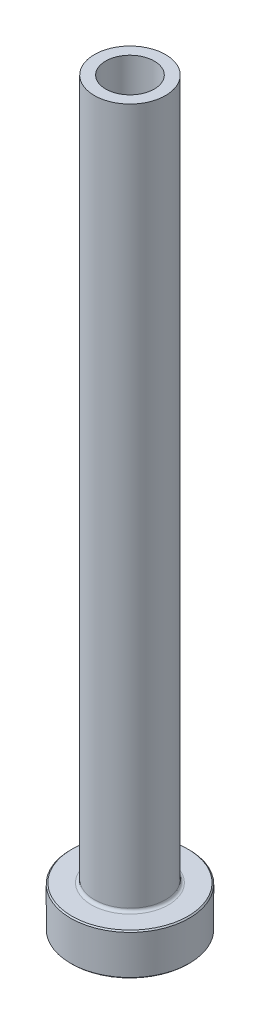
ISO-10303-21;
HEADER;
FILE_DESCRIPTION(('STEP AP214'),'2;1');
FILE_NAME('part.step','',(''),(''),'','','');
FILE_SCHEMA(('AUTOMOTIVE_DESIGN { 1 0 10303 214 1 1 1 1 }'));
ENDSEC;
DATA;
#1=APPLICATION_CONTEXT('core data for automotive mechanical design processes');
#2=APPLICATION_PROTOCOL_DEFINITION('international standard','automotive_design',2000,#1);
#3=PRODUCT_CONTEXT('',#1,'mechanical');
#4=PRODUCT('Part','Part','',(#3));
#5=PRODUCT_RELATED_PRODUCT_CATEGORY('part','',(#4));
#6=PRODUCT_DEFINITION_FORMATION('','',#4);
#7=PRODUCT_DEFINITION_CONTEXT('part definition',#1,'design');
#8=PRODUCT_DEFINITION('design','',#6,#7);
#9=PRODUCT_DEFINITION_SHAPE('','',#8);
#10=(LENGTH_UNIT() NAMED_UNIT(*) SI_UNIT(.MILLI.,.METRE.));
#11=(NAMED_UNIT(*) PLANE_ANGLE_UNIT() SI_UNIT($,.RADIAN.));
#12=(NAMED_UNIT(*) SI_UNIT($,.STERADIAN.) SOLID_ANGLE_UNIT());
#13=UNCERTAINTY_MEASURE_WITH_UNIT(LENGTH_MEASURE(1.E-05),#10,'distance_accuracy_value','');
#14=(GEOMETRIC_REPRESENTATION_CONTEXT(3) GLOBAL_UNCERTAINTY_ASSIGNED_CONTEXT((#13)) GLOBAL_UNIT_ASSIGNED_CONTEXT((#10,
#11,#12)) REPRESENTATION_CONTEXT('',''));
#15=CARTESIAN_POINT('',(0.,0.,0.));
#16=DIRECTION('',(0.,0.,1.));
#17=DIRECTION('',(1.,0.,0.));
#18=AXIS2_PLACEMENT_3D('',#15,#16,#17);
#19=CARTESIAN_POINT('',(0.,92.1876809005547,0.));
#20=DIRECTION('',(0.,1.,0.));
#21=DIRECTION('',(0.,0.,1.));
#22=AXIS2_PLACEMENT_3D('',#19,#20,#21);
#23=CYLINDRICAL_SURFACE('',#22,4.09999999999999);
#24=CARTESIAN_POINT('',(0.,125.,0.));
#25=DIRECTION('',(0.,1.,0.));
#26=DIRECTION('',(0.,0.,1.));
#27=AXIS2_PLACEMENT_3D('',#24,#25,#26);
#28=CIRCLE('',#27,4.1);
#29=CARTESIAN_POINT('',(0.,125.,4.1));
#30=VERTEX_POINT('',#29);
#31=EDGE_CURVE('E62',#30,#30,#28,.T.);
#32=ORIENTED_EDGE('',*,*,#31,.T.);
#33=EDGE_LOOP('',(#32));
#34=FACE_BOUND('',#33,.T.);
#35=CARTESIAN_POINT('',(0.,80.,0.));
#36=DIRECTION('',(0.,1.,0.));
#37=DIRECTION('',(0.,0.,1.));
#38=AXIS2_PLACEMENT_3D('',#35,#36,#37);
#39=CIRCLE('',#38,4.09999999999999);
#40=CARTESIAN_POINT('',(0.,80.,4.09999999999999));
#41=VERTEX_POINT('',#40);
#42=EDGE_CURVE('E71',#41,#41,#39,.T.);
#43=ORIENTED_EDGE('',*,*,#42,.F.);
#44=EDGE_LOOP('',(#43));
#45=FACE_BOUND('',#44,.T.);
#46=ADVANCED_FACE('F30',(#34,#45),#23,.F.);
#47=CARTESIAN_POINT('',(-4.1,125.,0.));
#48=DIRECTION('',(0.,1.,0.));
#49=DIRECTION('',(0.,0.,1.));
#50=AXIS2_PLACEMENT_3D('',#47,#48,#49);
#51=PLANE('',#50);
#52=CARTESIAN_POINT('',(0.,125.,0.));
#53=DIRECTION('',(0.,1.,0.));
#54=DIRECTION('',(0.,0.,1.));
#55=AXIS2_PLACEMENT_3D('',#52,#53,#54);
#56=CIRCLE('',#55,6.);
#57=CARTESIAN_POINT('',(0.,125.,6.));
#58=VERTEX_POINT('',#57);
#59=EDGE_CURVE('E65',#58,#58,#56,.T.);
#60=ORIENTED_EDGE('',*,*,#59,.T.);
#61=EDGE_LOOP('',(#60));
#62=FACE_BOUND('',#61,.T.);
#63=ORIENTED_EDGE('',*,*,#31,.F.);
#64=EDGE_LOOP('',(#63));
#65=FACE_BOUND('',#64,.T.);
#66=ADVANCED_FACE('F79',(#62,#65),#51,.T.);
#67=CARTESIAN_POINT('',(0.,92.1876809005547,0.));
#68=DIRECTION('',(0.,1.,0.));
#69=DIRECTION('',(0.,0.,1.));
#70=AXIS2_PLACEMENT_3D('',#67,#68,#69);
#71=CYLINDRICAL_SURFACE('',#70,6.);
#72=CARTESIAN_POINT('',(0.,7.50000000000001,0.));
#73=DIRECTION('',(0.,1.,0.));
#74=DIRECTION('',(0.,0.,1.));
#75=AXIS2_PLACEMENT_3D('',#72,#73,#74);
#76=CIRCLE('',#75,6.);
#77=CARTESIAN_POINT('',(0.,7.50000000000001,6.));
#78=VERTEX_POINT('',#77);
#79=EDGE_CURVE('E59',#78,#78,#76,.T.);
#80=ORIENTED_EDGE('',*,*,#79,.T.);
#81=EDGE_LOOP('',(#80));
#82=FACE_BOUND('',#81,.T.);
#83=ORIENTED_EDGE('',*,*,#59,.F.);
#84=EDGE_LOOP('',(#83));
#85=FACE_BOUND('',#84,.T.);
#86=ADVANCED_FACE('F85',(#82,#85),#71,.T.);
#87=CARTESIAN_POINT('',(-5.99999999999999,7.,0.));
#88=DIRECTION('',(0.,1.,0.));
#89=DIRECTION('',(0.,0.,1.));
#90=AXIS2_PLACEMENT_3D('',#87,#88,#89);
#91=PLANE('',#90);
#92=CARTESIAN_POINT('',(0.,7.,0.));
#93=DIRECTION('',(0.,1.,0.));
#94=DIRECTION('',(0.,0.,1.));
#95=AXIS2_PLACEMENT_3D('',#92,#93,#94);
#96=CIRCLE('',#95,9.79999999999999);
#97=CARTESIAN_POINT('',(0.,7.,9.79999999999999));
#98=VERTEX_POINT('',#97);
#99=EDGE_CURVE('E53',#98,#98,#96,.T.);
#100=ORIENTED_EDGE('',*,*,#99,.T.);
#101=EDGE_LOOP('',(#100));
#102=FACE_BOUND('',#101,.T.);
#103=CARTESIAN_POINT('',(0.,7.,0.));
#104=DIRECTION('',(0.,1.,0.));
#105=DIRECTION('',(0.,0.,1.));
#106=AXIS2_PLACEMENT_3D('',#103,#104,#105);
#107=CIRCLE('',#106,6.5);
#108=CARTESIAN_POINT('',(0.,7.,6.5));
#109=VERTEX_POINT('',#108);
#110=EDGE_CURVE('E56',#109,#109,#107,.F.);
#111=ORIENTED_EDGE('',*,*,#110,.T.);
#112=EDGE_LOOP('',(#111));
#113=FACE_BOUND('',#112,.T.);
#114=ADVANCED_FACE('F111',(#102,#113),#91,.T.);
#115=CARTESIAN_POINT('',(0.,92.1876809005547,0.));
#116=DIRECTION('',(0.,1.,0.));
#117=DIRECTION('',(0.,0.,1.));
#118=AXIS2_PLACEMENT_3D('',#115,#116,#117);
#119=CYLINDRICAL_SURFACE('',#118,9.99999999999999);
#120=CARTESIAN_POINT('',(0.,6.8,0.));
#121=DIRECTION('',(0.,1.,0.));
#122=DIRECTION('',(0.,0.,1.));
#123=AXIS2_PLACEMENT_3D('',#120,#121,#122);
#124=CIRCLE('',#123,9.99999999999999);
#125=CARTESIAN_POINT('',(0.,6.8,9.99999999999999));
#126=VERTEX_POINT('',#125);
#127=EDGE_CURVE('E45',#126,#126,#124,.F.);
#128=ORIENTED_EDGE('',*,*,#127,.T.);
#129=EDGE_LOOP('',(#128));
#130=FACE_BOUND('',#129,.T.);
#131=CARTESIAN_POINT('',(0.,0.200000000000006,0.));
#132=DIRECTION('',(0.,-1.,0.));
#133=DIRECTION('',(0.,0.,-1.));
#134=AXIS2_PLACEMENT_3D('',#131,#132,#133);
#135=CIRCLE('',#134,9.99999999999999);
#136=CARTESIAN_POINT('',(0.,0.200000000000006,-9.99999999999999));
#137=VERTEX_POINT('',#136);
#138=EDGE_CURVE('E50',#137,#137,#135,.F.);
#139=ORIENTED_EDGE('',*,*,#138,.T.);
#140=EDGE_LOOP('',(#139));
#141=FACE_BOUND('',#140,.T.);
#142=ADVANCED_FACE('F108',(#130,#141),#119,.T.);
#143=CARTESIAN_POINT('',(-9.99999999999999,0.,0.));
#144=DIRECTION('',(0.,-1.,0.));
#145=DIRECTION('',(0.,0.,-1.));
#146=AXIS2_PLACEMENT_3D('',#143,#144,#145);
#147=PLANE('',#146);
#148=CARTESIAN_POINT('',(0.,0.,0.));
#149=DIRECTION('',(0.,-1.,0.));
#150=DIRECTION('',(0.,0.,-1.));
#151=AXIS2_PLACEMENT_3D('',#148,#149,#150);
#152=CIRCLE('',#151,4.84999999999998);
#153=CARTESIAN_POINT('',(0.,0.,-4.84999999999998));
#154=VERTEX_POINT('',#153);
#155=EDGE_CURVE('E37',#154,#154,#152,.F.);
#156=ORIENTED_EDGE('',*,*,#155,.T.);
#157=EDGE_LOOP('',(#156));
#158=FACE_BOUND('',#157,.T.);
#159=CARTESIAN_POINT('',(0.,0.,0.));
#160=DIRECTION('',(0.,-1.,0.));
#161=DIRECTION('',(0.,0.,-1.));
#162=AXIS2_PLACEMENT_3D('',#159,#160,#161);
#163=CIRCLE('',#162,9.79999999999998);
#164=CARTESIAN_POINT('',(0.,0.,-9.79999999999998));
#165=VERTEX_POINT('',#164);
#166=EDGE_CURVE('E41',#165,#165,#163,.T.);
#167=ORIENTED_EDGE('',*,*,#166,.T.);
#168=EDGE_LOOP('',(#167));
#169=FACE_BOUND('',#168,.T.);
#170=ADVANCED_FACE('F110',(#158,#169),#147,.T.);
#171=CARTESIAN_POINT('',(0.,92.1876809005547,0.));
#172=DIRECTION('',(0.,1.,0.));
#173=DIRECTION('',(0.,0.,1.));
#174=AXIS2_PLACEMENT_3D('',#171,#172,#173);
#175=CYLINDRICAL_SURFACE('',#174,4.34999999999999);
#176=CARTESIAN_POINT('',(0.,0.499999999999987,0.));
#177=DIRECTION('',(0.,-1.,0.));
#178=DIRECTION('',(0.,0.,-1.));
#179=AXIS2_PLACEMENT_3D('',#176,#177,#178);
#180=CIRCLE('',#179,4.34999999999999);
#181=CARTESIAN_POINT('',(0.,0.499999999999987,-4.34999999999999));
#182=VERTEX_POINT('',#181);
#183=EDGE_CURVE('E10',#182,#182,#180,.T.);
#184=ORIENTED_EDGE('',*,*,#183,.T.);
#185=EDGE_LOOP('',(#184));
#186=FACE_BOUND('',#185,.T.);
#187=CARTESIAN_POINT('',(0.,68.,0.));
#188=DIRECTION('',(0.,1.,0.));
#189=DIRECTION('',(0.,0.,1.));
#190=AXIS2_PLACEMENT_3D('',#187,#188,#189);
#191=CIRCLE('',#190,4.35);
#192=CARTESIAN_POINT('',(0.,68.,4.35));
#193=VERTEX_POINT('',#192);
#194=EDGE_CURVE('E68',#193,#193,#191,.T.);
#195=ORIENTED_EDGE('',*,*,#194,.T.);
#196=EDGE_LOOP('',(#195));
#197=FACE_BOUND('',#196,.T.);
#198=ADVANCED_FACE('F118',(#186,#197),#175,.F.);
#199=CARTESIAN_POINT('',(0.,68.,0.));
#200=DIRECTION('',(0.,-1.,0.));
#201=DIRECTION('',(0.,0.,-1.));
#202=AXIS2_PLACEMENT_3D('',#199,#200,#201);
#203=CONICAL_SURFACE('',#202,4.35,0.0208303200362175);
#204=ORIENTED_EDGE('',*,*,#42,.T.);
#205=EDGE_LOOP('',(#204));
#206=FACE_BOUND('',#205,.T.);
#207=ORIENTED_EDGE('',*,*,#194,.F.);
#208=EDGE_LOOP('',(#207));
#209=FACE_BOUND('',#208,.T.);
#210=ADVANCED_FACE('F75',(#206,#209),#203,.F.);
#211=CARTESIAN_POINT('',(0.,7.50000000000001,0.));
#212=DIRECTION('',(0.,1.,0.));
#213=DIRECTION('',(0.,0.,1.));
#214=AXIS2_PLACEMENT_3D('',#211,#212,#213);
#215=TOROIDAL_SURFACE('',#214,6.5,0.5);
#216=ORIENTED_EDGE('',*,*,#110,.F.);
#217=EDGE_LOOP('',(#216));
#218=FACE_BOUND('',#217,.T.);
#219=ORIENTED_EDGE('',*,*,#79,.F.);
#220=EDGE_LOOP('',(#219));
#221=FACE_BOUND('',#220,.T.);
#222=ADVANCED_FACE('F90',(#218,#221),#215,.F.);
#223=CARTESIAN_POINT('',(0.,7.00000000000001,0.));
#224=DIRECTION('',(0.,-1.,0.));
#225=DIRECTION('',(0.,0.,-1.));
#226=AXIS2_PLACEMENT_3D('',#223,#224,#225);
#227=CONICAL_SURFACE('',#226,9.79999999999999,0.785398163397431);
#228=ORIENTED_EDGE('',*,*,#127,.F.);
#229=EDGE_LOOP('',(#228));
#230=FACE_BOUND('',#229,.T.);
#231=ORIENTED_EDGE('',*,*,#99,.F.);
#232=EDGE_LOOP('',(#231));
#233=FACE_BOUND('',#232,.T.);
#234=ADVANCED_FACE('F93',(#230,#233),#227,.T.);
#235=CARTESIAN_POINT('',(0.,0.200000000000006,0.));
#236=DIRECTION('',(0.,1.,0.));
#237=DIRECTION('',(0.,0.,1.));
#238=AXIS2_PLACEMENT_3D('',#235,#236,#237);
#239=CONICAL_SURFACE('',#238,9.99999999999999,0.785398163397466);
#240=ORIENTED_EDGE('',*,*,#166,.F.);
#241=EDGE_LOOP('',(#240));
#242=FACE_BOUND('',#241,.T.);
#243=ORIENTED_EDGE('',*,*,#138,.F.);
#244=EDGE_LOOP('',(#243));
#245=FACE_BOUND('',#244,.T.);
#246=ADVANCED_FACE('F96',(#242,#245),#239,.T.);
#247=CARTESIAN_POINT('',(0.,0.,0.));
#248=DIRECTION('',(0.,-1.,0.));
#249=DIRECTION('',(0.,0.,-1.));
#250=AXIS2_PLACEMENT_3D('',#247,#248,#249);
#251=CONICAL_SURFACE('',#250,4.84999999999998,0.785398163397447);
#252=ORIENTED_EDGE('',*,*,#183,.F.);
#253=EDGE_LOOP('',(#252));
#254=FACE_BOUND('',#253,.T.);
#255=ORIENTED_EDGE('',*,*,#155,.F.);
#256=EDGE_LOOP('',(#255));
#257=FACE_BOUND('',#256,.T.);
#258=ADVANCED_FACE('F32',(#254,#257),#251,.F.);
#259=CLOSED_SHELL('',(#46,#66,#86,#114,#142,#170,#198,#210,#222,#234,#246,#258));
#260=MANIFOLD_SOLID_BREP('B2',#259);
#261=ADVANCED_BREP_SHAPE_REPRESENTATION('',(#18,#260),#14);
#262=SHAPE_DEFINITION_REPRESENTATION(#9,#261);
ENDSEC;
END-ISO-10303-21;
